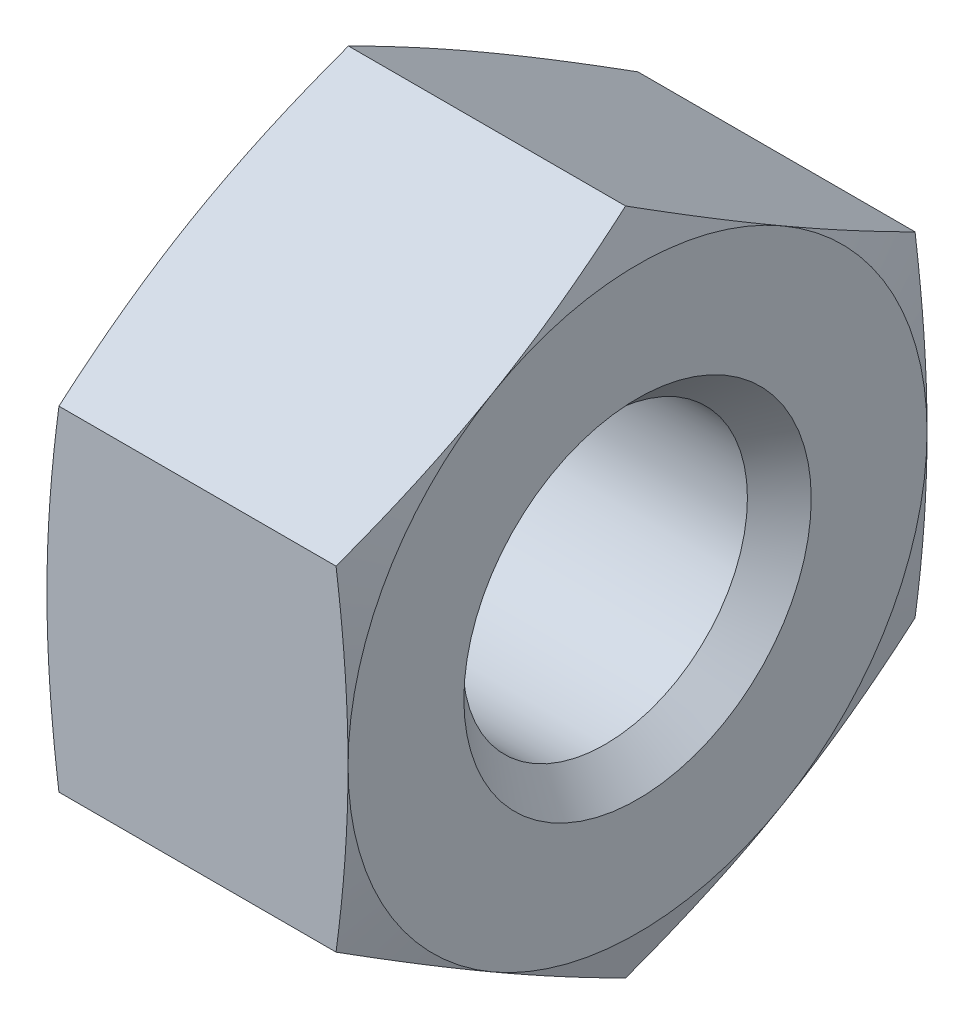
ISO-10303-21;
HEADER;
FILE_DESCRIPTION(('STEP AP214'),'2;1');
FILE_NAME('part.step','',(''),(''),'','','');
FILE_SCHEMA(('AUTOMOTIVE_DESIGN { 1 0 10303 214 1 1 1 1 }'));
ENDSEC;
DATA;
#1=APPLICATION_CONTEXT('core data for automotive mechanical design processes');
#2=APPLICATION_PROTOCOL_DEFINITION('international standard','automotive_design',2000,#1);
#3=PRODUCT_CONTEXT('',#1,'mechanical');
#4=PRODUCT('Part','Part','',(#3));
#5=PRODUCT_RELATED_PRODUCT_CATEGORY('part','',(#4));
#6=PRODUCT_DEFINITION_FORMATION('','',#4);
#7=PRODUCT_DEFINITION_CONTEXT('part definition',#1,'design');
#8=PRODUCT_DEFINITION('design','',#6,#7);
#9=PRODUCT_DEFINITION_SHAPE('','',#8);
#10=(LENGTH_UNIT() NAMED_UNIT(*) SI_UNIT(.MILLI.,.METRE.));
#11=(NAMED_UNIT(*) PLANE_ANGLE_UNIT() SI_UNIT($,.RADIAN.));
#12=(NAMED_UNIT(*) SI_UNIT($,.STERADIAN.) SOLID_ANGLE_UNIT());
#13=UNCERTAINTY_MEASURE_WITH_UNIT(LENGTH_MEASURE(1.E-05),#10,'distance_accuracy_value','');
#14=(GEOMETRIC_REPRESENTATION_CONTEXT(3) GLOBAL_UNCERTAINTY_ASSIGNED_CONTEXT((#13)) GLOBAL_UNIT_ASSIGNED_CONTEXT((#10,
#11,#12)) REPRESENTATION_CONTEXT('',''));
#15=CARTESIAN_POINT('',(0.,0.,0.));
#16=DIRECTION('',(0.,0.,1.));
#17=DIRECTION('',(1.,0.,0.));
#18=AXIS2_PLACEMENT_3D('',#15,#16,#17);
#19=CARTESIAN_POINT('',(6.2,2.88675134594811,5.));
#20=DIRECTION('',(0.,0.,-1.));
#21=DIRECTION('',(-1.,0.,0.));
#22=AXIS2_PLACEMENT_3D('',#19,#20,#21);
#23=PLANE('',#22);
#24=CARTESIAN_POINT('',(0.207259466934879,-2.88675143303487,4.99999995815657));
#25=CARTESIAN_POINT('',(0.175186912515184,-2.64743948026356,4.99999998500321));
#26=CARTESIAN_POINT('',(0.146063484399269,-2.40769797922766,4.99999999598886));
#27=CARTESIAN_POINT('',(0.0949189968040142,-1.92774019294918,5.00000000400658));
#28=CARTESIAN_POINT('',(0.0728898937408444,-1.68752475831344,5.00000000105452));
#29=CARTESIAN_POINT('',(0.0370556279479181,-1.20640160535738,4.99999999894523));
#30=CARTESIAN_POINT('',(0.0232524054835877,-0.965493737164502,4.9999999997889));
#31=CARTESIAN_POINT('',(0.0093512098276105,-0.603743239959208,5.00000000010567));
#32=CARTESIAN_POINT('',(0.00585136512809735,-0.483024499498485,5.00000000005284));
#33=CARTESIAN_POINT('',(0.0011729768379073,-0.241538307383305,4.99999999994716));
#34=CARTESIAN_POINT('',(-5.49206439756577E-06,-0.120770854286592,4.99999999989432));
#35=CARTESIAN_POINT('',(3.25961728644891E-12,0.,5.));
#36=B_SPLINE_CURVE_WITH_KNOTS('',3,(#24,#25,#26,#27,#28,#29,#30,#31,#32,#33,#34,#35),
.UNSPECIFIED.,.F.,.F.,(4,2,2,2,2,4),(0.,0.724386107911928,1.44794798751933,2.17168046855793,
2.53396918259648,2.89626955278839),.UNSPECIFIED.);
#37=CARTESIAN_POINT('',(0.207259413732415,-2.88675137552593,4.99999994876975));
#38=VERTEX_POINT('',#37);
#39=CARTESIAN_POINT('',(2.65037292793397E-12,0.,4.99999999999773));
#40=VERTEX_POINT('',#39);
#41=EDGE_CURVE('E401',#38,#40,#36,.T.);
#42=ORIENTED_EDGE('',*,*,#41,.F.);
#43=DIRECTION('',(1.,0.,0.));
#44=VECTOR('',#43,1.);
#45=CARTESIAN_POINT('',(6.2,-2.88675134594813,5.));
#46=LINE('',#45,#44);
#47=CARTESIAN_POINT('',(4.99274057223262,-2.88675139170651,5.));
#48=VERTEX_POINT('',#47);
#49=EDGE_CURVE('E456',#38,#48,#46,.T.);
#50=ORIENTED_EDGE('',*,*,#49,.T.);
#51=CARTESIAN_POINT('',(5.19999999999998,0.,5.));
#52=CARTESIAN_POINT('',(5.20000549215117,-0.120770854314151,5.));
#53=CARTESIAN_POINT('',(5.19882702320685,-0.241538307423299,5.));
#54=CARTESIAN_POINT('',(5.1941486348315,-0.483024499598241,5.));
#55=CARTESIAN_POINT('',(5.19064879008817,-0.603743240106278,5.));
#56=CARTESIAN_POINT('',(5.176747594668,-0.96549373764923,5.));
#57=CARTESIAN_POINT('',(5.16294437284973,-1.20640160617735,5.));
#58=CARTESIAN_POINT('',(5.12711010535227,-1.68752475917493,5.));
#59=CARTESIAN_POINT('',(5.10508099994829,-1.92774019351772,5.));
#60=CARTESIAN_POINT('',(5.05393651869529,-2.40769798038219,5.));
#61=CARTESIAN_POINT('',(5.02481309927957,-2.64743948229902,5.));
#62=CARTESIAN_POINT('',(4.99274056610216,-2.88675143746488,5.));
#63=B_SPLINE_CURVE_WITH_KNOTS('',3,(#51,#52,#53,#54,#55,#56,#57,#58,#59,#60,#61,#62),
.UNSPECIFIED.,.F.,.F.,(4,2,2,2,2,4),(0.,0.362300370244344,0.724589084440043,1.44832156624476,
2.17188344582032,2.89626955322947),.UNSPECIFIED.);
#64=CARTESIAN_POINT('',(5.19999999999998,0.,5.));
#65=VERTEX_POINT('',#64);
#66=EDGE_CURVE('E488',#65,#48,#63,.T.);
#67=ORIENTED_EDGE('',*,*,#66,.F.);
#68=CARTESIAN_POINT('',(4.99274056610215,2.8867514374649,5.));
#69=CARTESIAN_POINT('',(5.02481309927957,2.64743948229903,5.));
#70=CARTESIAN_POINT('',(5.05393651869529,2.4076979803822,5.));
#71=CARTESIAN_POINT('',(5.10508099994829,1.92774019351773,5.));
#72=CARTESIAN_POINT('',(5.12711010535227,1.68752475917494,5.));
#73=CARTESIAN_POINT('',(5.16294437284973,1.20640160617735,5.));
#74=CARTESIAN_POINT('',(5.176747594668,0.965493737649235,5.));
#75=CARTESIAN_POINT('',(5.19064879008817,0.60374324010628,5.));
#76=CARTESIAN_POINT('',(5.1941486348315,0.483024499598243,5.));
#77=CARTESIAN_POINT('',(5.19882702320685,0.2415383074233,5.));
#78=CARTESIAN_POINT('',(5.20000549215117,0.120770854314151,5.));
#79=CARTESIAN_POINT('',(5.19999999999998,0.,5.));
#80=B_SPLINE_CURVE_WITH_KNOTS('',3,(#68,#69,#70,#71,#72,#73,#74,#75,#76,#77,#78,#79),
.UNSPECIFIED.,.F.,.F.,(4,2,2,2,2,4),(0.,0.724386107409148,1.44794798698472,2.17168046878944,
2.53396918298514,2.89626955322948),.UNSPECIFIED.);
#81=CARTESIAN_POINT('',(4.99274058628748,2.88675137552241,4.99999994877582));
#82=VERTEX_POINT('',#81);
#83=EDGE_CURVE('E370',#82,#65,#80,.T.);
#84=ORIENTED_EDGE('',*,*,#83,.F.);
#85=DIRECTION('',(1.,0.,0.));
#86=VECTOR('',#85,1.);
#87=CARTESIAN_POINT('',(6.2,2.88675134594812,5.));
#88=LINE('',#87,#86);
#89=CARTESIAN_POINT('',(0.207259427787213,2.88675139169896,5.));
#90=VERTEX_POINT('',#89);
#91=EDGE_CURVE('E147',#82,#90,#88,.F.);
#92=ORIENTED_EDGE('',*,*,#91,.T.);
#93=CARTESIAN_POINT('',(3.25963181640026E-12,0.,5.));
#94=CARTESIAN_POINT('',(-5.49214790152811E-06,0.120770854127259,5.));
#95=CARTESIAN_POINT('',(0.0011729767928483,0.241538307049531,5.));
#96=CARTESIAN_POINT('',(0.00585136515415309,0.483024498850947,5.));
#97=CARTESIAN_POINT('',(0.0093512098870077,0.603743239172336,5.));
#98=CARTESIAN_POINT('',(0.0232524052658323,0.965493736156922,5.));
#99=CARTESIAN_POINT('',(0.0370556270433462,1.20640160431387,5.));
#100=CARTESIAN_POINT('',(0.0728898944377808,1.68752475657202,5.));
#101=CARTESIAN_POINT('',(0.094918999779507,1.92774019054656,5.));
#102=CARTESIAN_POINT('',(0.146063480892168,2.40769797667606,5.));
#103=CARTESIAN_POINT('',(0.175186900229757,2.64743947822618,5.));
#104=CARTESIAN_POINT('',(0.207259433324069,2.88675143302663,5.));
#105=B_SPLINE_CURVE_WITH_KNOTS('',3,(#93,#94,#95,#96,#97,#98,#99,#100,#101,#102,#103,#104),
.UNSPECIFIED.,.F.,.F.,(4,2,2,2,2,4),(0.,0.362300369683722,0.724589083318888,1.44832156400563,
2.17188344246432,2.89626954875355),.UNSPECIFIED.);
#106=EDGE_CURVE('E311',#40,#90,#105,.T.);
#107=ORIENTED_EDGE('',*,*,#106,.F.);
#108=EDGE_LOOP('',(#42,#50,#67,#84,#92,#107));
#109=FACE_BOUND('',#108,.T.);
#110=ADVANCED_FACE('F41',(#109),#23,.F.);
#111=CARTESIAN_POINT('',(6.2,-2.88675134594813,5.));
#112=DIRECTION('',(0.,0.866025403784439,-0.5));
#113=DIRECTION('',(0.,0.5,0.866025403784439));
#114=AXIS2_PLACEMENT_3D('',#111,#112,#113);
#115=PLANE('',#114);
#116=CARTESIAN_POINT('',(0.207259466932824,-5.77350269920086,-9.63355038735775E-08));
#117=CARTESIAN_POINT('',(0.175186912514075,-5.65384674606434,0.207250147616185));
#118=CARTESIAN_POINT('',(0.146063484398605,-5.53397600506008,0.414872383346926));
#119=CARTESIAN_POINT('',(0.0949189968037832,-5.29399711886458,0.830528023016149));
#120=CARTESIAN_POINT('',(0.0728898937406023,-5.17388939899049,1.03856069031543));
#121=CARTESIAN_POINT('',(0.0370556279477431,-4.93332782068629,1.45522556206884));
#122=CARTESIAN_POINT('',(0.0232524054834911,-4.81287388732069,1.66385789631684));
#123=CARTESIAN_POINT('',(0.00935120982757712,-4.63199863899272,1.97714301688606));
#124=CARTESIAN_POINT('',(0.00585136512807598,-4.57163926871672,2.08168851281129));
#125=CARTESIAN_POINT('',(0.00117297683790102,-4.45089617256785,2.29082168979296));
#126=CARTESIAN_POINT('',(-5.49206440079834E-06,-4.39051244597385,2.39540937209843));
#127=CARTESIAN_POINT('',(3.25962493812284E-12,-4.33012701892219,2.5));
#128=B_SPLINE_CURVE_WITH_KNOTS('',3,(#116,#117,#118,#119,#120,#121,#122,#123,#124,#125,#126,
#127),.UNSPECIFIED.,.F.,.F.,(4,2,2,2,2,4),(0.,0.72438610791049,1.44794798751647,
2.17168046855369,2.53396918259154,2.89626955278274),.UNSPECIFIED.);
#129=CARTESIAN_POINT('',(0.207259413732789,-5.77350266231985,-5.12278189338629E-08));
#130=VERTEX_POINT('',#129);
#131=CARTESIAN_POINT('',(2.65034948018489E-12,-4.33012701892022,2.49999999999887));
#132=VERTEX_POINT('',#131);
#133=EDGE_CURVE('E342',#130,#132,#128,.T.);
#134=ORIENTED_EDGE('',*,*,#133,.F.);
#135=DIRECTION('',(1.,0.,0.));
#136=VECTOR('',#135,1.);
#137=CARTESIAN_POINT('',(6.2,-5.77350269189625,0.));
#138=LINE('',#137,#136);
#139=CARTESIAN_POINT('',(4.99274057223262,-5.77350271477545,-3.96279240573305E-08));
#140=VERTEX_POINT('',#139);
#141=EDGE_CURVE('E449',#130,#140,#138,.T.);
#142=ORIENTED_EDGE('',*,*,#141,.T.);
#143=CARTESIAN_POINT('',(5.19999999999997,-4.33012701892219,2.5));
#144=CARTESIAN_POINT('',(5.20000549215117,-4.39051244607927,2.3954093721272));
#145=CARTESIAN_POINT('',(5.19882702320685,-4.45089617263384,2.29082168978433));
#146=CARTESIAN_POINT('',(5.1941486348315,-4.57163926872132,2.08168851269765));
#147=CARTESIAN_POINT('',(5.19064879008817,-4.63199863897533,1.97714301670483));
#148=CARTESIAN_POINT('',(5.176747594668,-4.81287388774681,1.66385789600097));
#149=CARTESIAN_POINT('',(5.16294437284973,-4.93332782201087,1.45522556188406));
#150=CARTESIAN_POINT('',(5.12711010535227,-5.17388939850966,1.03856068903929));
#151=CARTESIAN_POINT('',(5.10508099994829,-5.29399711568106,0.830528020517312));
#152=CARTESIAN_POINT('',(5.05393651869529,-5.53397600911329,0.414872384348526));
#153=CARTESIAN_POINT('',(5.02481309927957,-5.65384676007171,0.207250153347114));
#154=CARTESIAN_POINT('',(4.99274056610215,-5.77350273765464,-7.92558495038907E-08));
#155=B_SPLINE_CURVE_WITH_KNOTS('',3,(#143,#144,#145,#146,#147,#148,#149,#150,#151,#152,#153,
#154),.UNSPECIFIED.,.F.,.F.,(4,2,2,2,2,4),(0.,0.362300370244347,0.724589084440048,
1.44832156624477,2.17188344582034,2.89626955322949),.UNSPECIFIED.);
#156=CARTESIAN_POINT('',(5.19999999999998,-4.33012701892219,2.5));
#157=VERTEX_POINT('',#156);
#158=EDGE_CURVE('E221',#157,#140,#155,.T.);
#159=ORIENTED_EDGE('',*,*,#158,.F.);
#160=CARTESIAN_POINT('',(4.99274059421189,-2.88675140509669,4.99999989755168));
#161=CARTESIAN_POINT('',(5.02481312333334,-3.00640737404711,4.79274967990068));
#162=CARTESIAN_POINT('',(5.05393653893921,-3.12627811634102,4.58512746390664));
#163=CARTESIAN_POINT('',(5.10508101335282,-3.36625699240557,4.16947185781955));
#164=CARTESIAN_POINT('',(5.1271101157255,-3.48636470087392,3.9614392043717));
#165=CARTESIAN_POINT('',(5.16294437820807,-3.72692625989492,3.54477436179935));
#166=CARTESIAN_POINT('',(5.17674759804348,-3.84738018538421,3.33614204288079));
#167=CARTESIAN_POINT('',(5.19064879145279,-4.02825542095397,3.02285694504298));
#168=CARTESIAN_POINT('',(5.1941486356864,-4.08861478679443,2.91831145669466));
#169=CARTESIAN_POINT('',(5.19882702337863,-4.20935787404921,2.70917829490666));
#170=CARTESIAN_POINT('',(5.20000549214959,-4.26974159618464,2.60459062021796));
#171=CARTESIAN_POINT('',(5.19999999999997,-4.33012701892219,2.5));
#172=B_SPLINE_CURVE_WITH_KNOTS('',3,(#160,#161,#162,#163,#164,#165,#166,#167,#168,#169,#170,
#171),.UNSPECIFIED.,.F.,.F.,(4,2,2,2,2,4),(0.,0.724386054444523,1.44794788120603,
2.17168031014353,2.53396899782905,2.89626934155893),.UNSPECIFIED.);
#173=EDGE_CURVE('E390',#48,#157,#172,.T.);
#174=ORIENTED_EDGE('',*,*,#173,.F.);
#175=ORIENTED_EDGE('',*,*,#49,.F.);
#176=CARTESIAN_POINT('',(3.2595374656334E-12,-4.33012701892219,2.5));
#177=CARTESIAN_POINT('',(-5.49214635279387E-06,-4.2697415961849,2.60459062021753));
#178=CARTESIAN_POINT('',(0.00117297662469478,-4.20935787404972,2.70917829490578));
#179=CARTESIAN_POINT('',(0.00585136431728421,-4.08861478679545,2.91831145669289));
#180=CARTESIAN_POINT('',(0.00935120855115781,-4.02825542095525,3.02285694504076));
#181=CARTESIAN_POINT('',(0.0232524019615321,-3.8473801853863,3.33614204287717));
#182=CARTESIAN_POINT('',(0.037055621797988,-3.72692625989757,3.54477436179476));
#183=CARTESIAN_POINT('',(0.0728898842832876,-3.48636470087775,3.96143920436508));
#184=CARTESIAN_POINT('',(0.0949189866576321,-3.36625699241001,4.16947185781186));
#185=CARTESIAN_POINT('',(0.146063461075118,-3.12627811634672,4.58512746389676));
#186=CARTESIAN_POINT('',(0.175186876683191,-3.00640737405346,4.79274967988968));
#187=CARTESIAN_POINT('',(0.207259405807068,-2.88675140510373,4.9999998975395));
#188=B_SPLINE_CURVE_WITH_KNOTS('',3,(#176,#177,#178,#179,#180,#181,#182,#183,#184,#185,#186,
#187),.UNSPECIFIED.,.F.,.F.,(4,2,2,2,2,4),(0.,0.36230034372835,0.72458903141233,
1.44832146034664,2.17188328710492,2.89626934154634),.UNSPECIFIED.);
#189=EDGE_CURVE('E126',#132,#38,#188,.T.);
#190=ORIENTED_EDGE('',*,*,#189,.F.);
#191=EDGE_LOOP('',(#134,#142,#159,#174,#175,#190));
#192=FACE_BOUND('',#191,.T.);
#193=ADVANCED_FACE('F491',(#192),#115,.F.);
#194=CARTESIAN_POINT('',(6.2,-5.77350269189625,0.));
#195=DIRECTION('',(0.,0.866025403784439,0.5));
#196=DIRECTION('',(0.,-0.5,0.866025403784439));
#197=AXIS2_PLACEMENT_3D('',#194,#195,#196);
#198=PLANE('',#197);
#199=CARTESIAN_POINT('',(0.20725946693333,-2.8867512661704,-5.00000005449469));
#200=CARTESIAN_POINT('',(0.175186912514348,-3.0064072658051,-4.79274983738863));
#201=CARTESIAN_POINT('',(0.146063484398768,-3.12627802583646,-4.58512761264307));
#202=CARTESIAN_POINT('',(0.0949189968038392,-3.3662569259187,-4.1694719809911));
#203=CARTESIAN_POINT('',(0.0728898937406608,-3.48636464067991,-3.96143931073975));
#204=CARTESIAN_POINT('',(0.0370556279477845,-3.72692621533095,-3.54477443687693));
#205=CARTESIAN_POINT('',(0.0232524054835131,-3.84738015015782,-3.33614210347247));
#206=CARTESIAN_POINT('',(0.00935120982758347,-4.02825539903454,-3.02285698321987));
#207=CARTESIAN_POINT('',(0.00585136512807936,-4.08861476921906,-2.91831148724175));
#208=CARTESIAN_POINT('',(0.00117297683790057,-4.20935786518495,-2.70917831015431));
#209=CARTESIAN_POINT('',(-5.49206440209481E-06,-4.26974159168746,-2.60459062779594));
#210=CARTESIAN_POINT('',(3.25736667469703E-12,-4.33012701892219,-2.5));
#211=B_SPLINE_CURVE_WITH_KNOTS('',3,(#199,#200,#201,#202,#203,#204,#205,#206,#207,#208,#209,
#210),.UNSPECIFIED.,.F.,.F.,(4,2,2,2,2,4),(0.,0.724386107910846,1.44794798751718,
2.17168046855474,2.53396918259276,2.89626955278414),.UNSPECIFIED.);
#212=CARTESIAN_POINT('',(0.207259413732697,-2.88675128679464,-5.));
#213=VERTEX_POINT('',#212);
#214=CARTESIAN_POINT('',(2.64907934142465E-12,-4.33012701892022,-2.49999999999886));
#215=VERTEX_POINT('',#214);
#216=EDGE_CURVE('E343',#213,#215,#211,.T.);
#217=ORIENTED_EDGE('',*,*,#216,.F.);
#218=DIRECTION('',(1.,0.,0.));
#219=VECTOR('',#218,1.);
#220=CARTESIAN_POINT('',(6.2,-2.88675134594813,-5.));
#221=LINE('',#220,#219);
#222=CARTESIAN_POINT('',(4.9927405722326,-2.88675132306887,-5.00000003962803));
#223=VERTEX_POINT('',#222);
#224=EDGE_CURVE('E455',#213,#223,#221,.T.);
#225=ORIENTED_EDGE('',*,*,#224,.T.);
#226=CARTESIAN_POINT('',(5.19999999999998,-4.33012701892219,-2.5));
#227=CARTESIAN_POINT('',(5.20000549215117,-4.26974159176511,-2.60459062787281));
#228=CARTESIAN_POINT('',(5.19882702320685,-4.20935786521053,-2.70917831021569));
#229=CARTESIAN_POINT('',(5.1941486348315,-4.08861476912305,-2.91831148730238));
#230=CARTESIAN_POINT('',(5.19064879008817,-4.02825539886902,-3.02285698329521));
#231=CARTESIAN_POINT('',(5.176747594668,-3.84738015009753,-3.33614210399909));
#232=CARTESIAN_POINT('',(5.16294437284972,-3.72692621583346,-3.54477443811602));
#233=CARTESIAN_POINT('',(5.12711010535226,-3.48636463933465,-3.96143931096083));
#234=CARTESIAN_POINT('',(5.10508099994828,-3.36625692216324,-4.16947197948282));
#235=CARTESIAN_POINT('',(5.05393651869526,-3.12627802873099,-4.58512761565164));
#236=CARTESIAN_POINT('',(5.02481309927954,-3.00640727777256,-4.79274984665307));
#237=CARTESIAN_POINT('',(4.99274056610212,-2.88675130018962,-5.00000007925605));
#238=B_SPLINE_CURVE_WITH_KNOTS('',3,(#226,#227,#228,#229,#230,#231,#232,#233,#234,#235,#236,
#237),.UNSPECIFIED.,.F.,.F.,(4,2,2,2,2,4),(0.,0.362300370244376,0.724589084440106,
1.44832156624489,2.17188344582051,2.89626955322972),.UNSPECIFIED.);
#239=CARTESIAN_POINT('',(5.19999999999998,-4.33012701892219,-2.5));
#240=VERTEX_POINT('',#239);
#241=EDGE_CURVE('E154',#240,#223,#238,.T.);
#242=ORIENTED_EDGE('',*,*,#241,.F.);
#243=CARTESIAN_POINT('',(4.99274059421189,-5.77350263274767,-1.0244834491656E-07));
#244=CARTESIAN_POINT('',(5.02481312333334,-5.65384666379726,-0.207250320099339));
#245=CARTESIAN_POINT('',(5.05393653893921,-5.53397592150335,-0.414872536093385));
#246=CARTESIAN_POINT('',(5.10508101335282,-5.2939970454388,-0.830528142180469));
#247=CARTESIAN_POINT('',(5.1271101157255,-5.17388933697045,-1.03856079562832));
#248=CARTESIAN_POINT('',(5.16294437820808,-4.93332777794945,-1.45522563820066));
#249=CARTESIAN_POINT('',(5.17674759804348,-4.81287385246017,-1.66385795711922));
#250=CARTESIAN_POINT('',(5.19064879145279,-4.63199861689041,-1.97714305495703));
#251=CARTESIAN_POINT('',(5.1941486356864,-4.57163925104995,-2.08168854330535));
#252=CARTESIAN_POINT('',(5.19882702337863,-4.45089616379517,-2.29082170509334));
#253=CARTESIAN_POINT('',(5.20000549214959,-4.39051244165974,-2.39540937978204));
#254=CARTESIAN_POINT('',(5.19999999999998,-4.33012701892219,-2.5));
#255=B_SPLINE_CURVE_WITH_KNOTS('',3,(#243,#244,#245,#246,#247,#248,#249,#250,#251,#252,#253,
#254),.UNSPECIFIED.,.F.,.F.,(4,2,2,2,2,4),(0.,0.724386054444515,1.44794788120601,
2.17168031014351,2.53396899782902,2.8962693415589),.UNSPECIFIED.);
#256=EDGE_CURVE('E451',#140,#240,#255,.T.);
#257=ORIENTED_EDGE('',*,*,#256,.F.);
#258=ORIENTED_EDGE('',*,*,#141,.F.);
#259=CARTESIAN_POINT('',(3.2573460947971E-12,-4.33012701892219,-2.5));
#260=CARTESIAN_POINT('',(-5.49214635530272E-06,-4.3905124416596,-2.39540937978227));
#261=CARTESIAN_POINT('',(0.00117297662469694,-4.4508961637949,-2.29082170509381));
#262=CARTESIAN_POINT('',(0.0058513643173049,-4.5716392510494,-2.0816885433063));
#263=CARTESIAN_POINT('',(0.00935120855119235,-4.63199861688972,-1.97714305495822));
#264=CARTESIAN_POINT('',(0.0232524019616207,-4.81287385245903,-1.6638579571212));
#265=CARTESIAN_POINT('',(0.0370556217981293,-4.93332777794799,-1.4552256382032));
#266=CARTESIAN_POINT('',(0.0728898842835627,-5.17388933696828,-1.03856079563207));
#267=CARTESIAN_POINT('',(0.0949189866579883,-5.29399704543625,-0.830528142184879));
#268=CARTESIAN_POINT('',(0.146063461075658,-5.53397592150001,-0.414872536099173));
#269=CARTESIAN_POINT('',(0.175186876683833,-5.6538466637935,-0.20725032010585));
#270=CARTESIAN_POINT('',(0.207259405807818,-5.77350263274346,-1.02455637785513E-07));
#271=B_SPLINE_CURVE_WITH_KNOTS('',3,(#259,#260,#261,#262,#263,#264,#265,#266,#267,#268,#269,
#270),.UNSPECIFIED.,.F.,.F.,(4,2,2,2,2,4),(0.,0.362300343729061,0.724589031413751,
1.44832146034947,2.17188328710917,2.89626934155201),.UNSPECIFIED.);
#272=EDGE_CURVE('E333',#215,#130,#271,.T.);
#273=ORIENTED_EDGE('',*,*,#272,.F.);
#274=EDGE_LOOP('',(#217,#225,#242,#257,#258,#273));
#275=FACE_BOUND('',#274,.T.);
#276=ADVANCED_FACE('F354',(#275),#198,.F.);
#277=CARTESIAN_POINT('',(6.2,-2.88675134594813,-5.));
#278=DIRECTION('',(0.,0.,1.));
#279=DIRECTION('',(1.,0.,0.));
#280=AXIS2_PLACEMENT_3D('',#277,#278,#279);
#281=PLANE('',#280);
#282=CARTESIAN_POINT('',(0.207259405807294,2.88675122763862,-5.));
#283=CARTESIAN_POINT('',(0.175186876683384,2.64743928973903,-5.));
#284=CARTESIAN_POINT('',(0.146063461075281,2.40769780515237,-5.));
#285=CARTESIAN_POINT('',(0.0949189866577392,1.9277400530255,-5.));
#286=CARTESIAN_POINT('',(0.0728898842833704,1.68752463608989,-5.));
#287=CARTESIAN_POINT('',(0.0370556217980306,1.20640151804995,-5.));
#288=CARTESIAN_POINT('',(0.0232524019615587,0.965493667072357,-5.));
#289=CARTESIAN_POINT('',(0.00935120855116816,0.603743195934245,-5.));
#290=CARTESIAN_POINT('',(0.00585136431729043,0.483024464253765,-5.));
#291=CARTESIAN_POINT('',(0.00117297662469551,0.241538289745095,-5.));
#292=CARTESIAN_POINT('',(-5.49214635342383E-06,0.120770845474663,-5.));
#293=CARTESIAN_POINT('',(3.25902439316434E-12,0.,-5.));
#294=B_SPLINE_CURVE_WITH_KNOTS('',3,(#282,#283,#284,#285,#286,#287,#288,#289,#290,#291,#292,
#293),.UNSPECIFIED.,.F.,.F.,(4,2,2,2,2,4),(0.,0.724386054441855,1.44794788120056,
2.1716803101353,2.53396899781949,2.89626934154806),.UNSPECIFIED.);
#295=CARTESIAN_POINT('',(0.207259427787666,2.88675132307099,-5.00000003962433));
#296=VERTEX_POINT('',#295);
#297=CARTESIAN_POINT('',(2.64977603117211E-12,0.,-4.99999999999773));
#298=VERTEX_POINT('',#297);
#299=EDGE_CURVE('E143',#296,#298,#294,.T.);
#300=ORIENTED_EDGE('',*,*,#299,.F.);
#301=DIRECTION('',(1.,0.,0.));
#302=VECTOR('',#301,1.);
#303=CARTESIAN_POINT('',(6.2,2.88675134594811,-5.));
#304=LINE('',#303,#302);
#305=CARTESIAN_POINT('',(4.99274057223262,2.88675139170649,-5.));
#306=VERTEX_POINT('',#305);
#307=EDGE_CURVE('E137',#296,#306,#304,.T.);
#308=ORIENTED_EDGE('',*,*,#307,.T.);
#309=CARTESIAN_POINT('',(5.19999999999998,0.,-5.));
#310=CARTESIAN_POINT('',(5.20000549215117,0.120770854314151,-5.));
#311=CARTESIAN_POINT('',(5.19882702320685,0.241538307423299,-5.));
#312=CARTESIAN_POINT('',(5.1941486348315,0.48302449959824,-5.));
#313=CARTESIAN_POINT('',(5.19064879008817,0.603743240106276,-5.));
#314=CARTESIAN_POINT('',(5.176747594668,0.965493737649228,-5.));
#315=CARTESIAN_POINT('',(5.16294437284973,1.20640160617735,-5.));
#316=CARTESIAN_POINT('',(5.12711010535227,1.68752475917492,-5.));
#317=CARTESIAN_POINT('',(5.10508099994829,1.92774019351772,-5.));
#318=CARTESIAN_POINT('',(5.05393651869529,2.40769798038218,-5.));
#319=CARTESIAN_POINT('',(5.02481309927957,2.64743948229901,-5.));
#320=CARTESIAN_POINT('',(4.99274056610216,2.88675143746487,-5.));
#321=B_SPLINE_CURVE_WITH_KNOTS('',3,(#309,#310,#311,#312,#313,#314,#315,#316,#317,#318,#319,
#320),.UNSPECIFIED.,.F.,.F.,(4,2,2,2,2,4),(0.,0.362300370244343,0.724589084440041,
1.44832156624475,2.17188344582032,2.89626955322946),.UNSPECIFIED.);
#322=CARTESIAN_POINT('',(5.19999999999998,0.,-5.));
#323=VERTEX_POINT('',#322);
#324=EDGE_CURVE('E140',#323,#306,#321,.T.);
#325=ORIENTED_EDGE('',*,*,#324,.F.);
#326=CARTESIAN_POINT('',(4.99274059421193,-2.88675122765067,-5.));
#327=CARTESIAN_POINT('',(5.02481312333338,-2.64743928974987,-5.));
#328=CARTESIAN_POINT('',(5.05393653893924,-2.40769780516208,-5.));
#329=CARTESIAN_POINT('',(5.10508101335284,-1.92774005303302,-5.));
#330=CARTESIAN_POINT('',(5.12711011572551,-1.68752463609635,-5.));
#331=CARTESIAN_POINT('',(5.16294437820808,-1.20640151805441,-5.));
#332=CARTESIAN_POINT('',(5.17674759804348,-0.965493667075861,-5.));
#333=CARTESIAN_POINT('',(5.19064879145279,-0.603743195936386,-5.));
#334=CARTESIAN_POINT('',(5.1941486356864,-0.483024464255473,-5.));
#335=CARTESIAN_POINT('',(5.19882702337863,-0.241538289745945,-5.));
#336=CARTESIAN_POINT('',(5.20000549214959,-0.120770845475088,-5.));
#337=CARTESIAN_POINT('',(5.19999999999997,0.,-5.));
#338=B_SPLINE_CURVE_WITH_KNOTS('',3,(#326,#327,#328,#329,#330,#331,#332,#333,#334,#335,#336,
#337),.UNSPECIFIED.,.F.,.F.,(4,2,2,2,2,4),(0.,0.72438605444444,1.44794788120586,
2.17168031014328,2.53396899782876,2.8962693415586),.UNSPECIFIED.);
#339=EDGE_CURVE('E213',#223,#323,#338,.T.);
#340=ORIENTED_EDGE('',*,*,#339,.F.);
#341=ORIENTED_EDGE('',*,*,#224,.F.);
#342=CARTESIAN_POINT('',(3.25901718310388E-12,0.,-5.));
#343=CARTESIAN_POINT('',(-5.49214635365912E-06,-0.12077084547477,-5.));
#344=CARTESIAN_POINT('',(0.00117297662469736,-0.241538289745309,-5.));
#345=CARTESIAN_POINT('',(0.00585136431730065,-0.483024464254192,-5.));
#346=CARTESIAN_POINT('',(0.00935120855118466,-0.603743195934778,-5.));
#347=CARTESIAN_POINT('',(0.0232524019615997,-0.965493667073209,-5.));
#348=CARTESIAN_POINT('',(0.0370556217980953,-1.20640151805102,-5.));
#349=CARTESIAN_POINT('',(0.0728898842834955,-1.68752463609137,-5.));
#350=CARTESIAN_POINT('',(0.0949189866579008,-1.92774005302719,-5.));
#351=CARTESIAN_POINT('',(0.146063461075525,-2.40769780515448,-5.));
#352=CARTESIAN_POINT('',(0.175186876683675,-2.64743928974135,-5.));
#353=CARTESIAN_POINT('',(0.207259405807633,-2.88675122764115,-5.));
#354=B_SPLINE_CURVE_WITH_KNOTS('',3,(#342,#343,#344,#345,#346,#347,#348,#349,#350,#351,#352,
#353),.UNSPECIFIED.,.F.,.F.,(4,2,2,2,2,4),(0.,0.362300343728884,0.724589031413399,
1.44832146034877,2.17188328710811,2.89626934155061),.UNSPECIFIED.);
#355=EDGE_CURVE('E266',#298,#213,#354,.T.);
#356=ORIENTED_EDGE('',*,*,#355,.F.);
#357=EDGE_LOOP('',(#300,#308,#325,#340,#341,#356));
#358=FACE_BOUND('',#357,.T.);
#359=ADVANCED_FACE('F138',(#358),#281,.F.);
#360=CARTESIAN_POINT('',(6.2,5.77350269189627,0.));
#361=DIRECTION('',(0.,-0.866025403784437,-0.500000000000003));
#362=DIRECTION('',(0.,0.500000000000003,-0.866025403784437));
#363=AXIS2_PLACEMENT_3D('',#360,#361,#362);
#364=PLANE('',#363);
#365=CARTESIAN_POINT('',(0.207259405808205,2.88675140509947,4.99999989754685));
#366=CARTESIAN_POINT('',(0.175186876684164,3.00640737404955,4.79274967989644));
#367=CARTESIAN_POINT('',(0.146063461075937,3.12627811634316,4.58512746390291));
#368=CARTESIAN_POINT('',(0.0949189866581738,3.36625699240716,4.16947185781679));
#369=CARTESIAN_POINT('',(0.0728898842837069,3.48636470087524,3.9614392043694));
#370=CARTESIAN_POINT('',(0.0370556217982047,3.72692625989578,3.54477436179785));
#371=CARTESIAN_POINT('',(0.0232524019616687,3.84738018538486,3.33614204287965));
#372=CARTESIAN_POINT('',(0.009351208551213,4.02825542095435,3.02285694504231));
#373=CARTESIAN_POINT('',(0.00585136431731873,4.08861478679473,2.91831145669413));
#374=CARTESIAN_POINT('',(0.00117297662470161,4.20935787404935,2.70917829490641));
#375=CARTESIAN_POINT('',(-5.49214635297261E-06,4.26974159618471,2.60459062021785));
#376=CARTESIAN_POINT('',(3.25951433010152E-12,4.33012701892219,2.50000000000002));
#377=B_SPLINE_CURVE_WITH_KNOTS('',3,(#365,#366,#367,#368,#369,#370,#371,#372,#373,#374,#375,
#376),.UNSPECIFIED.,.F.,.F.,(4,2,2,2,2,4),(0.,0.72438605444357,1.44794788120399,
2.17168031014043,2.53396899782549,2.89626934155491),.UNSPECIFIED.);
#378=CARTESIAN_POINT('',(2.65021353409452E-12,4.33012701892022,2.49999999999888));
#379=VERTEX_POINT('',#378);
#380=EDGE_CURVE('E436',#90,#379,#377,.T.);
#381=ORIENTED_EDGE('',*,*,#380,.F.);
#382=ORIENTED_EDGE('',*,*,#91,.F.);
#383=CARTESIAN_POINT('',(5.19999999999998,4.33012701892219,2.50000000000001));
#384=CARTESIAN_POINT('',(5.20000549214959,4.26974159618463,2.60459062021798));
#385=CARTESIAN_POINT('',(5.19882702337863,4.2093578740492,2.70917829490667));
#386=CARTESIAN_POINT('',(5.1941486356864,4.08861478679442,2.91831145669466));
#387=CARTESIAN_POINT('',(5.19064879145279,4.02825542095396,3.02285694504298));
#388=CARTESIAN_POINT('',(5.17674759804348,3.84738018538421,3.33614204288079));
#389=CARTESIAN_POINT('',(5.16294437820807,3.72692625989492,3.54477436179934));
#390=CARTESIAN_POINT('',(5.1271101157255,3.48636470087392,3.96143920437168));
#391=CARTESIAN_POINT('',(5.10508101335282,3.36625699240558,4.16947185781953));
#392=CARTESIAN_POINT('',(5.05393653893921,3.12627811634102,4.58512746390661));
#393=CARTESIAN_POINT('',(5.02481312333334,3.00640737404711,4.79274967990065));
#394=CARTESIAN_POINT('',(4.99274059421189,2.8867514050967,4.99999989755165));
#395=B_SPLINE_CURVE_WITH_KNOTS('',3,(#383,#384,#385,#386,#387,#388,#389,#390,#391,#392,#393,
#394),.UNSPECIFIED.,.F.,.F.,(4,2,2,2,2,4),(0.,0.362300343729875,0.724589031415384,
1.44832146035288,2.17188328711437,2.89626934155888),.UNSPECIFIED.);
#396=CARTESIAN_POINT('',(5.19999999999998,4.33012701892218,2.50000000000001));
#397=VERTEX_POINT('',#396);
#398=EDGE_CURVE('E377',#397,#82,#395,.T.);
#399=ORIENTED_EDGE('',*,*,#398,.F.);
#400=CARTESIAN_POINT('',(4.99274059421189,5.77350263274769,1.02448344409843E-07));
#401=CARTESIAN_POINT('',(5.02481312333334,5.65384666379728,0.207250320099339));
#402=CARTESIAN_POINT('',(5.05393653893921,5.53397592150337,0.414872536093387));
#403=CARTESIAN_POINT('',(5.10508101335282,5.29399704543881,0.830528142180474));
#404=CARTESIAN_POINT('',(5.1271101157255,5.17388933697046,1.03856079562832));
#405=CARTESIAN_POINT('',(5.16294437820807,4.93332777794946,1.45522563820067));
#406=CARTESIAN_POINT('',(5.17674759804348,4.81287385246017,1.66385795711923));
#407=CARTESIAN_POINT('',(5.19064879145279,4.63199861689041,1.97714305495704));
#408=CARTESIAN_POINT('',(5.1941486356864,4.57163925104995,2.08168854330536));
#409=CARTESIAN_POINT('',(5.19882702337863,4.45089616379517,2.29082170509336));
#410=CARTESIAN_POINT('',(5.20000549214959,4.39051244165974,2.39540937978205));
#411=CARTESIAN_POINT('',(5.19999999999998,4.33012701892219,2.50000000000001));
#412=B_SPLINE_CURVE_WITH_KNOTS('',3,(#400,#401,#402,#403,#404,#405,#406,#407,#408,#409,#410,
#411),.UNSPECIFIED.,.F.,.F.,(4,2,2,2,2,4),(0.,0.724386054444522,1.44794788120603,
2.17168031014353,2.53396899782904,2.89626934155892),.UNSPECIFIED.);
#413=CARTESIAN_POINT('',(4.99274057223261,5.77350271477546,3.96279264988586E-08));
#414=VERTEX_POINT('',#413);
#415=EDGE_CURVE('E160',#414,#397,#412,.T.);
#416=ORIENTED_EDGE('',*,*,#415,.F.);
#417=DIRECTION('',(1.,0.,0.));
#418=VECTOR('',#417,1.);
#419=CARTESIAN_POINT('',(6.2,5.77350269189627,0.));
#420=LINE('',#419,#418);
#421=CARTESIAN_POINT('',(0.207259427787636,5.77350271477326,-3.9624104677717E-08));
#422=VERTEX_POINT('',#421);
#423=EDGE_CURVE('E131',#414,#422,#420,.F.);
#424=ORIENTED_EDGE('',*,*,#423,.T.);
#425=CARTESIAN_POINT('',(3.2595157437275E-12,4.33012701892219,2.50000000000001));
#426=CARTESIAN_POINT('',(-5.49214790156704E-06,4.39051244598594,2.39540937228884));
#427=CARTESIAN_POINT('',(0.00117297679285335,4.45089617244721,2.29082169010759));
#428=CARTESIAN_POINT('',(0.00585136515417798,4.57163926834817,2.08168851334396));
#429=CARTESIAN_POINT('',(0.00935120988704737,4.631998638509,1.97714301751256));
#430=CARTESIAN_POINT('',(0.0232524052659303,4.81287388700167,1.6638578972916));
#431=CARTESIAN_POINT('',(0.0370556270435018,4.9333278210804,1.45522556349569));
#432=CARTESIAN_POINT('',(0.0728898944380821,5.17388939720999,1.0385606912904));
#433=CARTESIAN_POINT('',(0.0949189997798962,5.29399711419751,0.83052802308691));
#434=CARTESIAN_POINT('',(0.146063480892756,5.53397600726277,0.414872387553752));
#435=CARTESIAN_POINT('',(0.175186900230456,5.65384675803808,0.207250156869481));
#436=CARTESIAN_POINT('',(0.207259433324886,5.77350273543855,-7.54174501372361E-08));
#437=B_SPLINE_CURVE_WITH_KNOTS('',3,(#425,#426,#427,#428,#429,#430,#431,#432,#433,#434,#435,
#436),.UNSPECIFIED.,.F.,.F.,(4,2,2,2,2,4),(0.,0.362300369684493,0.724589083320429,
1.44832156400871,2.17188344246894,2.8962695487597),.UNSPECIFIED.);
#438=EDGE_CURVE('E297',#379,#422,#437,.T.);
#439=ORIENTED_EDGE('',*,*,#438,.F.);
#440=EDGE_LOOP('',(#381,#382,#399,#416,#424,#439));
#441=FACE_BOUND('',#440,.T.);
#442=ADVANCED_FACE('F247',(#441),#364,.F.);
#443=CARTESIAN_POINT('',(6.2,2.88675134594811,-5.));
#444=DIRECTION('',(0.,-0.866025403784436,0.500000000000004));
#445=DIRECTION('',(0.,-0.500000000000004,-0.866025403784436));
#446=AXIS2_PLACEMENT_3D('',#443,#444,#445);
#447=PLANE('',#446);
#448=CARTESIAN_POINT('',(0.207259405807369,5.77350263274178,-1.02458570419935E-07));
#449=CARTESIAN_POINT('',(0.175186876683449,5.65384666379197,-0.207250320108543));
#450=CARTESIAN_POINT('',(0.146063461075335,5.53397592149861,-0.414872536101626));
#451=CARTESIAN_POINT('',(0.0949189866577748,5.29399704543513,-0.83052814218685));
#452=CARTESIAN_POINT('',(0.0728898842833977,5.1738893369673,-1.0385607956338));
#453=CARTESIAN_POINT('',(0.0370556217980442,4.93332777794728,-1.45522563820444));
#454=CARTESIAN_POINT('',(0.023252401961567,4.81287385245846,-1.6638579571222));
#455=CARTESIAN_POINT('',(0.00935120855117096,4.63199861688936,-1.97714305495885));
#456=CARTESIAN_POINT('',(0.00585136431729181,4.57163925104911,-2.08168854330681));
#457=CARTESIAN_POINT('',(0.00117297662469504,4.45089616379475,-2.29082170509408));
#458=CARTESIAN_POINT('',(-5.49214635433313E-06,4.39051244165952,-2.39540937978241));
#459=CARTESIAN_POINT('',(3.25824128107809E-12,4.33012701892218,-2.50000000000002));
#460=B_SPLINE_CURVE_WITH_KNOTS('',3,(#448,#449,#450,#451,#452,#453,#454,#455,#456,#457,#458,
#459),.UNSPECIFIED.,.F.,.F.,(4,2,2,2,2,4),(0.,0.724386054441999,1.44794788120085,
2.17168031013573,2.53396899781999,2.89626934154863),.UNSPECIFIED.);
#461=CARTESIAN_POINT('',(2.64945949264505E-12,4.33012701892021,-2.49999999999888));
#462=VERTEX_POINT('',#461);
#463=EDGE_CURVE('E303',#422,#462,#460,.T.);
#464=ORIENTED_EDGE('',*,*,#463,.F.);
#465=ORIENTED_EDGE('',*,*,#423,.F.);
#466=CARTESIAN_POINT('',(5.19999999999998,4.33012701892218,-2.50000000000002));
#467=CARTESIAN_POINT('',(5.20000549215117,4.39051244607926,-2.39540937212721));
#468=CARTESIAN_POINT('',(5.19882702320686,4.45089617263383,-2.29082168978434));
#469=CARTESIAN_POINT('',(5.1941486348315,4.5716392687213,-2.08168851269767));
#470=CARTESIAN_POINT('',(5.19064879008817,4.63199863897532,-1.97714301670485));
#471=CARTESIAN_POINT('',(5.176747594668,4.81287388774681,-1.66385789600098));
#472=CARTESIAN_POINT('',(5.16294437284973,4.93332782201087,-1.45522556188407));
#473=CARTESIAN_POINT('',(5.12711010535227,5.17388939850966,-1.03856068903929));
#474=CARTESIAN_POINT('',(5.10508099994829,5.29399711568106,-0.830528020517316));
#475=CARTESIAN_POINT('',(5.05393651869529,5.5339760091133,-0.414872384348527));
#476=CARTESIAN_POINT('',(5.02481309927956,5.65384676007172,-0.207250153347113));
#477=CARTESIAN_POINT('',(4.99274056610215,5.77350273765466,7.92558523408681E-08));
#478=B_SPLINE_CURVE_WITH_KNOTS('',3,(#466,#467,#468,#469,#470,#471,#472,#473,#474,#475,#476,
#477),.UNSPECIFIED.,.F.,.F.,(4,2,2,2,2,4),(0.,0.362300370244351,0.724589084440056,
1.44832156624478,2.17188344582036,2.89626955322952),.UNSPECIFIED.);
#479=CARTESIAN_POINT('',(5.19999999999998,4.33012701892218,-2.50000000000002));
#480=VERTEX_POINT('',#479);
#481=EDGE_CURVE('E151',#480,#414,#478,.T.);
#482=ORIENTED_EDGE('',*,*,#481,.F.);
#483=CARTESIAN_POINT('',(4.99274059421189,2.88675140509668,-4.99999989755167));
#484=CARTESIAN_POINT('',(5.02481312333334,3.00640737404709,-4.79274967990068));
#485=CARTESIAN_POINT('',(5.05393653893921,3.126278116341,-4.58512746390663));
#486=CARTESIAN_POINT('',(5.10508101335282,3.36625699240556,-4.16947185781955));
#487=CARTESIAN_POINT('',(5.1271101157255,3.48636470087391,-3.9614392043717));
#488=CARTESIAN_POINT('',(5.16294437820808,3.72692625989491,-3.54477436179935));
#489=CARTESIAN_POINT('',(5.17674759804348,3.84738018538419,-3.3361420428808));
#490=CARTESIAN_POINT('',(5.19064879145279,4.02825542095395,-3.02285694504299));
#491=CARTESIAN_POINT('',(5.1941486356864,4.08861478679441,-2.91831145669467));
#492=CARTESIAN_POINT('',(5.19882702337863,4.20935787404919,-2.70917829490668));
#493=CARTESIAN_POINT('',(5.20000549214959,4.26974159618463,-2.60459062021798));
#494=CARTESIAN_POINT('',(5.19999999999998,4.33012701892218,-2.50000000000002));
#495=B_SPLINE_CURVE_WITH_KNOTS('',3,(#483,#484,#485,#486,#487,#488,#489,#490,#491,#492,#493,
#494),.UNSPECIFIED.,.F.,.F.,(4,2,2,2,2,4),(0.,0.724386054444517,1.44794788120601,
2.17168031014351,2.53396899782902,2.8962693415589),.UNSPECIFIED.);
#496=EDGE_CURVE('E58',#306,#480,#495,.T.);
#497=ORIENTED_EDGE('',*,*,#496,.F.);
#498=ORIENTED_EDGE('',*,*,#307,.F.);
#499=CARTESIAN_POINT('',(3.25807635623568E-12,4.33012701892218,-2.50000000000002));
#500=CARTESIAN_POINT('',(-5.49214790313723E-06,4.26974159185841,-2.60459062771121));
#501=CARTESIAN_POINT('',(0.00117297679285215,4.20935786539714,-2.70917830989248));
#502=CARTESIAN_POINT('',(0.00585136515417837,4.08861476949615,-2.91831148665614));
#503=CARTESIAN_POINT('',(0.00935120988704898,4.02825539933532,-3.02285698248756));
#504=CARTESIAN_POINT('',(0.0232524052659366,3.84738015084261,-3.33614210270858));
#505=CARTESIAN_POINT('',(0.0370556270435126,3.72692621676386,-3.54477443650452));
#506=CARTESIAN_POINT('',(0.0728898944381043,3.48636464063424,-3.96143930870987));
#507=CARTESIAN_POINT('',(0.0949189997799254,3.36625692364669,-4.1694719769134));
#508=CARTESIAN_POINT('',(0.146063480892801,3.1262780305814,-4.58512761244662));
#509=CARTESIAN_POINT('',(0.17518690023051,3.00640727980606,-4.79274984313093));
#510=CARTESIAN_POINT('',(0.207259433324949,2.88675130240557,-5.0000000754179));
#511=B_SPLINE_CURVE_WITH_KNOTS('',3,(#499,#500,#501,#502,#503,#504,#505,#506,#507,#508,#509,
#510),.UNSPECIFIED.,.F.,.F.,(4,2,2,2,2,4),(0.,0.362300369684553,0.72458908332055,
1.44832156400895,2.1718834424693,2.89626954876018),.UNSPECIFIED.);
#512=EDGE_CURVE('E256',#462,#296,#511,.T.);
#513=ORIENTED_EDGE('',*,*,#512,.F.);
#514=EDGE_LOOP('',(#464,#465,#482,#497,#498,#513));
#515=FACE_BOUND('',#514,.T.);
#516=ADVANCED_FACE('F149',(#515),#447,.F.);
#517=CARTESIAN_POINT('',(0.208502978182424,0.,0.));
#518=DIRECTION('',(1.,0.,0.));
#519=DIRECTION('',(0.,0.,-1.));
#520=AXIS2_PLACEMENT_3D('',#517,#518,#519);
#521=CONICAL_SURFACE('',#520,5.77814370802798,1.30899693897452);
#522=ORIENTED_EDGE('',*,*,#41,.T.);
#523=CARTESIAN_POINT('',(2.04082085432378E-12,0.,0.));
#524=DIRECTION('',(1.,0.,0.));
#525=DIRECTION('',(0.,0.,-1.));
#526=AXIS2_PLACEMENT_3D('',#523,#524,#525);
#527=CIRCLE('',#526,4.99999999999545);
#528=EDGE_CURVE('E241',#132,#40,#527,.F.);
#529=ORIENTED_EDGE('',*,*,#528,.F.);
#530=ORIENTED_EDGE('',*,*,#189,.T.);
#531=EDGE_LOOP('',(#522,#529,#530));
#532=FACE_BOUND('',#531,.T.);
#533=ADVANCED_FACE('F246',(#532),#521,.T.);
#534=CARTESIAN_POINT('',(0.208502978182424,0.,0.));
#535=DIRECTION('',(1.,0.,0.));
#536=DIRECTION('',(0.,0.,-1.));
#537=AXIS2_PLACEMENT_3D('',#534,#535,#536);
#538=CONICAL_SURFACE('',#537,5.77814370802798,1.30899693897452);
#539=CARTESIAN_POINT('',(2.04082085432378E-12,0.,0.));
#540=DIRECTION('',(1.,0.,0.));
#541=DIRECTION('',(0.,0.,-1.));
#542=AXIS2_PLACEMENT_3D('',#539,#540,#541);
#543=CIRCLE('',#542,4.99999999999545);
#544=EDGE_CURVE('E406',#40,#379,#543,.F.);
#545=ORIENTED_EDGE('',*,*,#544,.F.);
#546=ORIENTED_EDGE('',*,*,#106,.T.);
#547=ORIENTED_EDGE('',*,*,#380,.T.);
#548=EDGE_LOOP('',(#545,#546,#547));
#549=FACE_BOUND('',#548,.T.);
#550=ADVANCED_FACE('F293',(#549),#538,.T.);
#551=CARTESIAN_POINT('',(0.208502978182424,0.,0.));
#552=DIRECTION('',(1.,0.,0.));
#553=DIRECTION('',(0.,0.,-1.));
#554=AXIS2_PLACEMENT_3D('',#551,#552,#553);
#555=CONICAL_SURFACE('',#554,5.77814370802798,1.30899693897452);
#556=CARTESIAN_POINT('',(2.04082085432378E-12,0.,0.));
#557=DIRECTION('',(1.,0.,0.));
#558=DIRECTION('',(0.,0.,-1.));
#559=AXIS2_PLACEMENT_3D('',#556,#557,#558);
#560=CIRCLE('',#559,4.99999999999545);
#561=EDGE_CURVE('E426',#379,#462,#560,.F.);
#562=ORIENTED_EDGE('',*,*,#561,.F.);
#563=ORIENTED_EDGE('',*,*,#438,.T.);
#564=ORIENTED_EDGE('',*,*,#463,.T.);
#565=EDGE_LOOP('',(#562,#563,#564));
#566=FACE_BOUND('',#565,.T.);
#567=ADVANCED_FACE('F286',(#566),#555,.T.);
#568=CARTESIAN_POINT('',(0.208502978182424,0.,0.));
#569=DIRECTION('',(1.,0.,0.));
#570=DIRECTION('',(0.,0.,-1.));
#571=AXIS2_PLACEMENT_3D('',#568,#569,#570);
#572=CONICAL_SURFACE('',#571,5.77814370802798,1.30899693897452);
#573=CARTESIAN_POINT('',(2.04082085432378E-12,0.,0.));
#574=DIRECTION('',(1.,0.,0.));
#575=DIRECTION('',(0.,0.,-1.));
#576=AXIS2_PLACEMENT_3D('',#573,#574,#575);
#577=CIRCLE('',#576,4.99999999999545);
#578=EDGE_CURVE('E420',#462,#298,#577,.F.);
#579=ORIENTED_EDGE('',*,*,#578,.F.);
#580=ORIENTED_EDGE('',*,*,#512,.T.);
#581=ORIENTED_EDGE('',*,*,#299,.T.);
#582=EDGE_LOOP('',(#579,#580,#581));
#583=FACE_BOUND('',#582,.T.);
#584=ADVANCED_FACE('F281',(#583),#572,.T.);
#585=CARTESIAN_POINT('',(0.208502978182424,0.,0.));
#586=DIRECTION('',(1.,0.,0.));
#587=DIRECTION('',(0.,0.,-1.));
#588=AXIS2_PLACEMENT_3D('',#585,#586,#587);
#589=CONICAL_SURFACE('',#588,5.77814370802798,1.30899693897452);
#590=ORIENTED_EDGE('',*,*,#216,.T.);
#591=CARTESIAN_POINT('',(2.04082085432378E-12,0.,0.));
#592=DIRECTION('',(1.,0.,0.));
#593=DIRECTION('',(0.,0.,-1.));
#594=AXIS2_PLACEMENT_3D('',#591,#592,#593);
#595=CIRCLE('',#594,4.99999999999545);
#596=EDGE_CURVE('E410',#298,#215,#595,.F.);
#597=ORIENTED_EDGE('',*,*,#596,.F.);
#598=ORIENTED_EDGE('',*,*,#355,.T.);
#599=EDGE_LOOP('',(#590,#597,#598));
#600=FACE_BOUND('',#599,.T.);
#601=ADVANCED_FACE('F285',(#600),#589,.T.);
#602=CARTESIAN_POINT('',(0.208502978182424,0.,0.));
#603=DIRECTION('',(1.,0.,0.));
#604=DIRECTION('',(0.,0.,-1.));
#605=AXIS2_PLACEMENT_3D('',#602,#603,#604);
#606=CONICAL_SURFACE('',#605,5.77814370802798,1.30899693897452);
#607=ORIENTED_EDGE('',*,*,#133,.T.);
#608=CARTESIAN_POINT('',(2.04103769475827E-12,0.,0.));
#609=DIRECTION('',(1.,0.,0.));
#610=DIRECTION('',(0.,0.,-1.));
#611=AXIS2_PLACEMENT_3D('',#608,#609,#610);
#612=CIRCLE('',#611,4.99999999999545);
#613=EDGE_CURVE('E395',#215,#132,#612,.F.);
#614=ORIENTED_EDGE('',*,*,#613,.F.);
#615=ORIENTED_EDGE('',*,*,#272,.T.);
#616=EDGE_LOOP('',(#607,#614,#615));
#617=FACE_BOUND('',#616,.T.);
#618=ADVANCED_FACE('F356',(#617),#606,.T.);
#619=CARTESIAN_POINT('',(4.99149702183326,0.,0.));
#620=DIRECTION('',(-1.,0.,0.));
#621=DIRECTION('',(0.,0.,1.));
#622=AXIS2_PLACEMENT_3D('',#619,#620,#621);
#623=CONICAL_SURFACE('',#622,5.77814370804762,1.30899693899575);
#624=ORIENTED_EDGE('',*,*,#83,.T.);
#625=CARTESIAN_POINT('',(5.19999999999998,0.,0.));
#626=DIRECTION('',(-1.,0.,0.));
#627=DIRECTION('',(0.,0.,1.));
#628=AXIS2_PLACEMENT_3D('',#625,#626,#627);
#629=CIRCLE('',#628,4.99999999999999);
#630=EDGE_CURVE('E412',#397,#65,#629,.F.);
#631=ORIENTED_EDGE('',*,*,#630,.F.);
#632=ORIENTED_EDGE('',*,*,#398,.T.);
#633=EDGE_LOOP('',(#624,#631,#632));
#634=FACE_BOUND('',#633,.T.);
#635=ADVANCED_FACE('F360',(#634),#623,.T.);
#636=CARTESIAN_POINT('',(4.99149702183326,0.,0.));
#637=DIRECTION('',(-1.,0.,0.));
#638=DIRECTION('',(0.,0.,1.));
#639=AXIS2_PLACEMENT_3D('',#636,#637,#638);
#640=CONICAL_SURFACE('',#639,5.77814370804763,1.30899693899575);
#641=CARTESIAN_POINT('',(5.19999999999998,0.,0.));
#642=DIRECTION('',(-1.,0.,0.));
#643=DIRECTION('',(0.,0.,1.));
#644=AXIS2_PLACEMENT_3D('',#641,#642,#643);
#645=CIRCLE('',#644,4.99999999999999);
#646=EDGE_CURVE('E418',#65,#157,#645,.F.);
#647=ORIENTED_EDGE('',*,*,#646,.F.);
#648=ORIENTED_EDGE('',*,*,#66,.T.);
#649=ORIENTED_EDGE('',*,*,#173,.T.);
#650=EDGE_LOOP('',(#647,#648,#649));
#651=FACE_BOUND('',#650,.T.);
#652=ADVANCED_FACE('F365',(#651),#640,.T.);
#653=CARTESIAN_POINT('',(4.99149702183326,0.,0.));
#654=DIRECTION('',(-1.,0.,0.));
#655=DIRECTION('',(0.,0.,1.));
#656=AXIS2_PLACEMENT_3D('',#653,#654,#655);
#657=CONICAL_SURFACE('',#656,5.77814370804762,1.30899693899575);
#658=CARTESIAN_POINT('',(5.19999999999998,0.,0.));
#659=DIRECTION('',(-1.,0.,0.));
#660=DIRECTION('',(0.,0.,1.));
#661=AXIS2_PLACEMENT_3D('',#658,#659,#660);
#662=CIRCLE('',#661,4.99999999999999);
#663=EDGE_CURVE('E475',#157,#240,#662,.F.);
#664=ORIENTED_EDGE('',*,*,#663,.F.);
#665=ORIENTED_EDGE('',*,*,#158,.T.);
#666=ORIENTED_EDGE('',*,*,#256,.T.);
#667=EDGE_LOOP('',(#664,#665,#666));
#668=FACE_BOUND('',#667,.T.);
#669=ADVANCED_FACE('F202',(#668),#657,.T.);
#670=CARTESIAN_POINT('',(4.99149702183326,0.,0.));
#671=DIRECTION('',(-1.,0.,0.));
#672=DIRECTION('',(0.,0.,1.));
#673=AXIS2_PLACEMENT_3D('',#670,#671,#672);
#674=CONICAL_SURFACE('',#673,5.77814370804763,1.30899693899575);
#675=CARTESIAN_POINT('',(5.19999999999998,0.,0.));
#676=DIRECTION('',(-1.,0.,0.));
#677=DIRECTION('',(0.,0.,1.));
#678=AXIS2_PLACEMENT_3D('',#675,#676,#677);
#679=CIRCLE('',#678,4.99999999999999);
#680=EDGE_CURVE('E472',#240,#323,#679,.F.);
#681=ORIENTED_EDGE('',*,*,#680,.F.);
#682=ORIENTED_EDGE('',*,*,#241,.T.);
#683=ORIENTED_EDGE('',*,*,#339,.T.);
#684=EDGE_LOOP('',(#681,#682,#683));
#685=FACE_BOUND('',#684,.T.);
#686=ADVANCED_FACE('F195',(#685),#674,.T.);
#687=CARTESIAN_POINT('',(4.99149702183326,0.,0.));
#688=DIRECTION('',(-1.,0.,0.));
#689=DIRECTION('',(0.,0.,1.));
#690=AXIS2_PLACEMENT_3D('',#687,#688,#689);
#691=CONICAL_SURFACE('',#690,5.77814370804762,1.30899693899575);
#692=CARTESIAN_POINT('',(5.19999999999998,0.,0.));
#693=DIRECTION('',(-1.,0.,0.));
#694=DIRECTION('',(0.,0.,1.));
#695=AXIS2_PLACEMENT_3D('',#692,#693,#694);
#696=CIRCLE('',#695,4.99999999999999);
#697=EDGE_CURVE('E158',#323,#480,#696,.F.);
#698=ORIENTED_EDGE('',*,*,#697,.F.);
#699=ORIENTED_EDGE('',*,*,#324,.T.);
#700=ORIENTED_EDGE('',*,*,#496,.T.);
#701=EDGE_LOOP('',(#698,#699,#700));
#702=FACE_BOUND('',#701,.T.);
#703=ADVANCED_FACE('F156',(#702),#691,.T.);
#704=CARTESIAN_POINT('',(4.99149702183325,0.,0.));
#705=DIRECTION('',(-1.,0.,0.));
#706=DIRECTION('',(0.,0.,1.));
#707=AXIS2_PLACEMENT_3D('',#704,#705,#706);
#708=CONICAL_SURFACE('',#707,5.77814370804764,1.30899693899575);
#709=CARTESIAN_POINT('',(5.19999999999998,0.,0.));
#710=DIRECTION('',(-1.,0.,0.));
#711=DIRECTION('',(0.,0.,1.));
#712=AXIS2_PLACEMENT_3D('',#709,#710,#711);
#713=CIRCLE('',#712,4.99999999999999);
#714=EDGE_CURVE('E465',#480,#397,#713,.F.);
#715=ORIENTED_EDGE('',*,*,#714,.F.);
#716=ORIENTED_EDGE('',*,*,#481,.T.);
#717=ORIENTED_EDGE('',*,*,#415,.T.);
#718=EDGE_LOOP('',(#715,#716,#717));
#719=FACE_BOUND('',#718,.T.);
#720=ADVANCED_FACE('F194',(#719),#708,.T.);
#721=CARTESIAN_POINT('',(0.,0.,3.));
#722=DIRECTION('',(-1.,0.,0.));
#723=DIRECTION('',(0.,0.,1.));
#724=AXIS2_PLACEMENT_3D('',#721,#722,#723);
#725=PLANE('',#724);
#726=CARTESIAN_POINT('',(0.,0.,0.));
#727=DIRECTION('',(-1.,0.,0.));
#728=DIRECTION('',(0.,0.,1.));
#729=AXIS2_PLACEMENT_3D('',#726,#727,#728);
#730=CIRCLE('',#729,2.99999999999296);
#731=CARTESIAN_POINT('',(0.,0.,2.99999999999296));
#732=VERTEX_POINT('',#731);
#733=EDGE_CURVE('E596',#732,#732,#730,.F.);
#734=ORIENTED_EDGE('',*,*,#733,.T.);
#735=EDGE_LOOP('',(#734));
#736=FACE_BOUND('',#735,.T.);
#737=ORIENTED_EDGE('',*,*,#596,.T.);
#738=ORIENTED_EDGE('',*,*,#613,.T.);
#739=ORIENTED_EDGE('',*,*,#528,.T.);
#740=ORIENTED_EDGE('',*,*,#544,.T.);
#741=ORIENTED_EDGE('',*,*,#561,.T.);
#742=ORIENTED_EDGE('',*,*,#578,.T.);
#743=EDGE_LOOP('',(#737,#738,#739,#740,#741,#742));
#744=FACE_BOUND('',#743,.T.);
#745=ADVANCED_FACE('F407',(#736,#744),#725,.T.);
#746=CARTESIAN_POINT('',(5.2,0.,5.));
#747=DIRECTION('',(1.,0.,0.));
#748=DIRECTION('',(0.,0.,-1.));
#749=AXIS2_PLACEMENT_3D('',#746,#747,#748);
#750=PLANE('',#749);
#751=CARTESIAN_POINT('',(5.2,0.,0.));
#752=DIRECTION('',(1.,0.,0.));
#753=DIRECTION('',(0.,0.,-1.));
#754=AXIS2_PLACEMENT_3D('',#751,#752,#753);
#755=CIRCLE('',#754,3.00000000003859);
#756=CARTESIAN_POINT('',(5.2,0.,-3.00000000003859));
#757=VERTEX_POINT('',#756);
#758=EDGE_CURVE('E50',#757,#757,#755,.F.);
#759=ORIENTED_EDGE('',*,*,#758,.T.);
#760=EDGE_LOOP('',(#759));
#761=FACE_BOUND('',#760,.T.);
#762=ORIENTED_EDGE('',*,*,#697,.T.);
#763=ORIENTED_EDGE('',*,*,#714,.T.);
#764=ORIENTED_EDGE('',*,*,#630,.T.);
#765=ORIENTED_EDGE('',*,*,#646,.T.);
#766=ORIENTED_EDGE('',*,*,#663,.T.);
#767=ORIENTED_EDGE('',*,*,#680,.T.);
#768=EDGE_LOOP('',(#762,#763,#764,#765,#766,#767));
#769=FACE_BOUND('',#768,.T.);
#770=ADVANCED_FACE('F483',(#761,#769),#750,.T.);
#771=CARTESIAN_POINT('',(0.,0.,0.));
#772=DIRECTION('',(-1.,0.,0.));
#773=DIRECTION('',(0.,0.,1.));
#774=AXIS2_PLACEMENT_3D('',#771,#772,#773);
#775=CYLINDRICAL_SURFACE('',#774,2.45850000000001);
#776=CARTESIAN_POINT('',(4.63926033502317,0.,0.));
#777=DIRECTION('',(1.,0.,0.));
#778=DIRECTION('',(0.,0.,-1.));
#779=AXIS2_PLACEMENT_3D('',#776,#777,#778);
#780=CIRCLE('',#779,2.45850000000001);
#781=CARTESIAN_POINT('',(4.63926033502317,0.,-2.45850000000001));
#782=VERTEX_POINT('',#781);
#783=EDGE_CURVE('E12',#782,#782,#780,.T.);
#784=ORIENTED_EDGE('',*,*,#783,.T.);
#785=EDGE_LOOP('',(#784));
#786=FACE_BOUND('',#785,.T.);
#787=CARTESIAN_POINT('',(0.541499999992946,0.,0.));
#788=DIRECTION('',(-1.,0.,0.));
#789=DIRECTION('',(0.,0.,1.));
#790=AXIS2_PLACEMENT_3D('',#787,#788,#789);
#791=CIRCLE('',#790,2.45850000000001);
#792=CARTESIAN_POINT('',(0.541499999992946,0.,2.45850000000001));
#793=VERTEX_POINT('',#792);
#794=EDGE_CURVE('E469',#793,#793,#791,.T.);
#795=ORIENTED_EDGE('',*,*,#794,.T.);
#796=EDGE_LOOP('',(#795));
#797=FACE_BOUND('',#796,.T.);
#798=ADVANCED_FACE('F607',(#786,#797),#775,.F.);
#799=CARTESIAN_POINT('',(0.541499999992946,0.,0.));
#800=DIRECTION('',(-1.,0.,0.));
#801=DIRECTION('',(0.,0.,1.));
#802=AXIS2_PLACEMENT_3D('',#799,#800,#801);
#803=CONICAL_SURFACE('',#802,2.45850000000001,0.785398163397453);
#804=ORIENTED_EDGE('',*,*,#733,.F.);
#805=EDGE_LOOP('',(#804));
#806=FACE_BOUND('',#805,.T.);
#807=ORIENTED_EDGE('',*,*,#794,.F.);
#808=EDGE_LOOP('',(#807));
#809=FACE_BOUND('',#808,.T.);
#810=ADVANCED_FACE('F522',(#806,#809),#803,.F.);
#811=CARTESIAN_POINT('',(5.2,0.,0.));
#812=DIRECTION('',(1.,0.,0.));
#813=DIRECTION('',(0.,0.,-1.));
#814=AXIS2_PLACEMENT_3D('',#811,#812,#813);
#815=CONICAL_SURFACE('',#814,3.00000000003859,0.767944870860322);
#816=ORIENTED_EDGE('',*,*,#783,.F.);
#817=EDGE_LOOP('',(#816));
#818=FACE_BOUND('',#817,.T.);
#819=ORIENTED_EDGE('',*,*,#758,.F.);
#820=EDGE_LOOP('',(#819));
#821=FACE_BOUND('',#820,.T.);
#822=ADVANCED_FACE('F43',(#818,#821),#815,.F.);
#823=CLOSED_SHELL('',(#110,#193,#276,#359,#442,#516,#533,#550,#567,#584,#601,#618,#635,#652,
#669,#686,#703,#720,#745,#770,#798,#810,#822));
#824=MANIFOLD_SOLID_BREP('B2',#823);
#825=ADVANCED_BREP_SHAPE_REPRESENTATION('',(#18,#824),#14);
#826=SHAPE_DEFINITION_REPRESENTATION(#9,#825);
ENDSEC;
END-ISO-10303-21;
